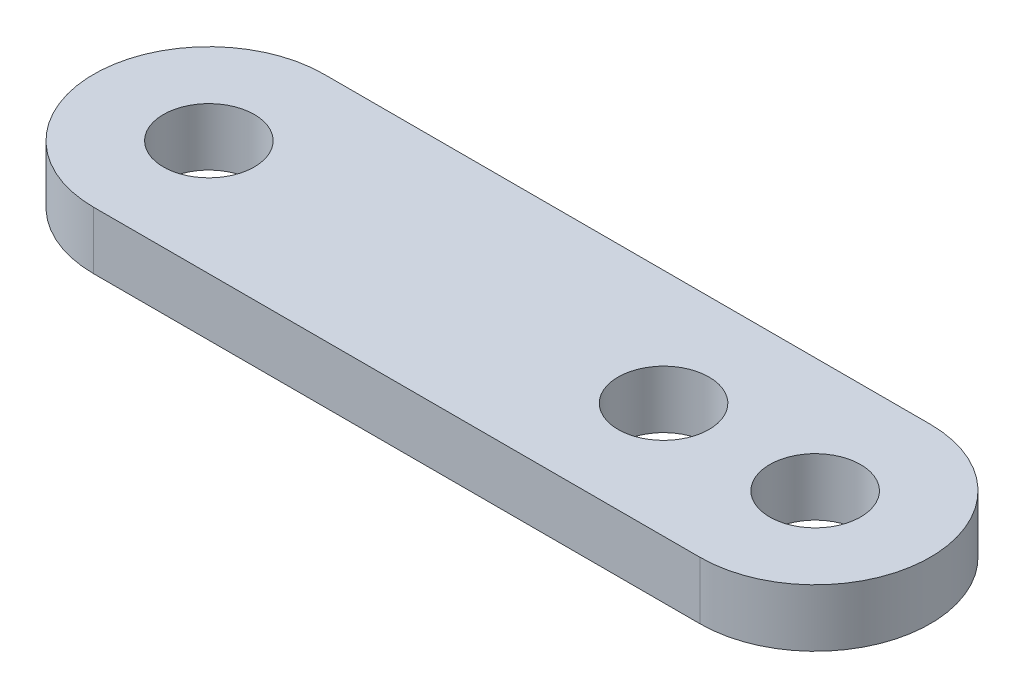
ISO-10303-21;
HEADER;
FILE_DESCRIPTION(('STEP AP214'),'2;1');
FILE_NAME('part.step','',(''),(''),'','','');
FILE_SCHEMA(('AUTOMOTIVE_DESIGN { 1 0 10303 214 1 1 1 1 }'));
ENDSEC;
DATA;
#1=APPLICATION_CONTEXT('core data for automotive mechanical design processes');
#2=APPLICATION_PROTOCOL_DEFINITION('international standard','automotive_design',2000,#1);
#3=PRODUCT_CONTEXT('',#1,'mechanical');
#4=PRODUCT('Part','Part','',(#3));
#5=PRODUCT_RELATED_PRODUCT_CATEGORY('part','',(#4));
#6=PRODUCT_DEFINITION_FORMATION('','',#4);
#7=PRODUCT_DEFINITION_CONTEXT('part definition',#1,'design');
#8=PRODUCT_DEFINITION('design','',#6,#7);
#9=PRODUCT_DEFINITION_SHAPE('','',#8);
#10=(LENGTH_UNIT() NAMED_UNIT(*) SI_UNIT(.MILLI.,.METRE.));
#11=(NAMED_UNIT(*) PLANE_ANGLE_UNIT() SI_UNIT($,.RADIAN.));
#12=(NAMED_UNIT(*) SI_UNIT($,.STERADIAN.) SOLID_ANGLE_UNIT());
#13=UNCERTAINTY_MEASURE_WITH_UNIT(LENGTH_MEASURE(1.E-05),#10,'distance_accuracy_value','');
#14=(GEOMETRIC_REPRESENTATION_CONTEXT(3) GLOBAL_UNCERTAINTY_ASSIGNED_CONTEXT((#13)) GLOBAL_UNIT_ASSIGNED_CONTEXT((#10,
#11,#12)) REPRESENTATION_CONTEXT('',''));
#15=CARTESIAN_POINT('',(0.,0.,0.));
#16=DIRECTION('',(0.,0.,1.));
#17=DIRECTION('',(1.,0.,0.));
#18=AXIS2_PLACEMENT_3D('',#15,#16,#17);
#19=CARTESIAN_POINT('',(-10.,1.9,0.));
#20=DIRECTION('',(0.,-1.,0.));
#21=DIRECTION('',(0.,0.,-1.));
#22=AXIS2_PLACEMENT_3D('',#19,#20,#21);
#23=CYLINDRICAL_SURFACE('',#22,3.8);
#24=CARTESIAN_POINT('',(-10.,0.,0.));
#25=DIRECTION('',(0.,1.,0.));
#26=DIRECTION('',(0.,0.,1.));
#27=AXIS2_PLACEMENT_3D('',#24,#25,#26);
#28=CIRCLE('',#27,3.8);
#29=CARTESIAN_POINT('',(-10.,0.,-3.8));
#30=VERTEX_POINT('',#29);
#31=CARTESIAN_POINT('',(-10.,0.,3.8));
#32=VERTEX_POINT('',#31);
#33=EDGE_CURVE('E129',#30,#32,#28,.T.);
#34=ORIENTED_EDGE('',*,*,#33,.T.);
#35=DIRECTION('',(0.,-1.,0.));
#36=VECTOR('',#35,1.);
#37=CARTESIAN_POINT('',(-10.,1.9,3.8));
#38=LINE('',#37,#36);
#39=CARTESIAN_POINT('',(-10.,1.9,3.8));
#40=VERTEX_POINT('',#39);
#41=EDGE_CURVE('E11',#40,#32,#38,.T.);
#42=ORIENTED_EDGE('',*,*,#41,.F.);
#43=CARTESIAN_POINT('',(-10.,1.9,0.));
#44=DIRECTION('',(0.,1.,0.));
#45=DIRECTION('',(0.,0.,1.));
#46=AXIS2_PLACEMENT_3D('',#43,#44,#45);
#47=CIRCLE('',#46,3.8);
#48=CARTESIAN_POINT('',(-10.,1.9,-3.8));
#49=VERTEX_POINT('',#48);
#50=EDGE_CURVE('E89',#49,#40,#47,.T.);
#51=ORIENTED_EDGE('',*,*,#50,.F.);
#52=DIRECTION('',(0.,-1.,0.));
#53=VECTOR('',#52,1.);
#54=CARTESIAN_POINT('',(-10.,1.9,-3.8));
#55=LINE('',#54,#53);
#56=EDGE_CURVE('E116',#49,#30,#55,.T.);
#57=ORIENTED_EDGE('',*,*,#56,.T.);
#58=EDGE_LOOP('',(#34,#42,#51,#57));
#59=FACE_BOUND('',#58,.T.);
#60=ADVANCED_FACE('F45',(#59),#23,.T.);
#61=CARTESIAN_POINT('',(0.,1.9,3.8));
#62=DIRECTION('',(0.,0.,1.));
#63=DIRECTION('',(1.,0.,0.));
#64=AXIS2_PLACEMENT_3D('',#61,#62,#63);
#65=PLANE('',#64);
#66=DIRECTION('',(-1.,0.,0.));
#67=VECTOR('',#66,1.);
#68=CARTESIAN_POINT('',(0.,0.,3.8));
#69=LINE('',#68,#67);
#70=CARTESIAN_POINT('',(9.99999999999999,0.,3.8));
#71=VERTEX_POINT('',#70);
#72=EDGE_CURVE('E99',#71,#32,#69,.T.);
#73=ORIENTED_EDGE('',*,*,#72,.F.);
#74=DIRECTION('',(0.,-1.,0.));
#75=VECTOR('',#74,1.);
#76=CARTESIAN_POINT('',(9.99999999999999,1.9,3.8));
#77=LINE('',#76,#75);
#78=CARTESIAN_POINT('',(9.99999999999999,1.9,3.8));
#79=VERTEX_POINT('',#78);
#80=EDGE_CURVE('E55',#79,#71,#77,.T.);
#81=ORIENTED_EDGE('',*,*,#80,.F.);
#82=DIRECTION('',(-1.,0.,0.));
#83=VECTOR('',#82,1.);
#84=CARTESIAN_POINT('',(0.,1.9,3.8));
#85=LINE('',#84,#83);
#86=EDGE_CURVE('E97',#79,#40,#85,.T.);
#87=ORIENTED_EDGE('',*,*,#86,.T.);
#88=ORIENTED_EDGE('',*,*,#41,.T.);
#89=EDGE_LOOP('',(#73,#81,#87,#88));
#90=FACE_BOUND('',#89,.T.);
#91=ADVANCED_FACE('F96',(#90),#65,.T.);
#92=CARTESIAN_POINT('',(10.,1.9,0.));
#93=DIRECTION('',(0.,-1.,0.));
#94=DIRECTION('',(0.,0.,-1.));
#95=AXIS2_PLACEMENT_3D('',#92,#93,#94);
#96=CYLINDRICAL_SURFACE('',#95,3.8);
#97=CARTESIAN_POINT('',(10.,0.,0.));
#98=DIRECTION('',(0.,1.,0.));
#99=DIRECTION('',(0.,0.,1.));
#100=AXIS2_PLACEMENT_3D('',#97,#98,#99);
#101=CIRCLE('',#100,3.8);
#102=CARTESIAN_POINT('',(9.99999999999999,0.,-3.8));
#103=VERTEX_POINT('',#102);
#104=EDGE_CURVE('E78',#71,#103,#101,.T.);
#105=ORIENTED_EDGE('',*,*,#104,.T.);
#106=DIRECTION('',(0.,-1.,0.));
#107=VECTOR('',#106,1.);
#108=CARTESIAN_POINT('',(9.99999999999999,1.9,-3.8));
#109=LINE('',#108,#107);
#110=CARTESIAN_POINT('',(9.99999999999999,1.9,-3.8));
#111=VERTEX_POINT('',#110);
#112=EDGE_CURVE('E101',#111,#103,#109,.T.);
#113=ORIENTED_EDGE('',*,*,#112,.F.);
#114=CARTESIAN_POINT('',(10.,1.9,0.));
#115=DIRECTION('',(0.,1.,0.));
#116=DIRECTION('',(0.,0.,1.));
#117=AXIS2_PLACEMENT_3D('',#114,#115,#116);
#118=CIRCLE('',#117,3.8);
#119=EDGE_CURVE('E102',#79,#111,#118,.T.);
#120=ORIENTED_EDGE('',*,*,#119,.F.);
#121=ORIENTED_EDGE('',*,*,#80,.T.);
#122=EDGE_LOOP('',(#105,#113,#120,#121));
#123=FACE_BOUND('',#122,.T.);
#124=ADVANCED_FACE('F103',(#123),#96,.T.);
#125=CARTESIAN_POINT('',(-10.,1.9,0.));
#126=DIRECTION('',(0.,-1.,0.));
#127=DIRECTION('',(0.,0.,-1.));
#128=AXIS2_PLACEMENT_3D('',#125,#126,#127);
#129=CYLINDRICAL_SURFACE('',#128,1.5);
#130=CARTESIAN_POINT('',(-10.,1.9,0.));
#131=DIRECTION('',(0.,1.,0.));
#132=DIRECTION('',(0.,0.,1.));
#133=AXIS2_PLACEMENT_3D('',#130,#131,#132);
#134=CIRCLE('',#133,1.5);
#135=CARTESIAN_POINT('',(-10.,1.9,-1.5));
#136=VERTEX_POINT('',#135);
#137=EDGE_CURVE('E110',#136,#136,#134,.T.);
#138=CARTESIAN_POINT('',(-10.,0.,0.));
#139=DIRECTION('',(0.,1.,0.));
#140=DIRECTION('',(0.,0.,1.));
#141=AXIS2_PLACEMENT_3D('',#138,#139,#140);
#142=CIRCLE('',#141,1.5);
#143=CARTESIAN_POINT('',(-10.,0.,-1.5));
#144=VERTEX_POINT('',#143);
#145=EDGE_CURVE('E125',#144,#144,#142,.T.);
#146=CARTESIAN_POINT('',(-10.,1.9,-1.5));
#147=CARTESIAN_POINT('',(-10.,1.88020833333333,-1.5));
#148=CARTESIAN_POINT('',(-10.,1.86041666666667,-1.5));
#149=CARTESIAN_POINT('',(-10.,1.82083333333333,-1.5));
#150=CARTESIAN_POINT('',(-10.,1.80104166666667,-1.5));
#151=CARTESIAN_POINT('',(-10.,1.76145833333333,-1.5));
#152=CARTESIAN_POINT('',(-10.,1.74166666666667,-1.5));
#153=CARTESIAN_POINT('',(-10.,1.70208333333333,-1.5));
#154=CARTESIAN_POINT('',(-10.,1.68229166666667,-1.5));
#155=CARTESIAN_POINT('',(-10.,1.64270833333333,-1.5));
#156=CARTESIAN_POINT('',(-10.,1.62291666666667,-1.5));
#157=CARTESIAN_POINT('',(-10.,1.58333333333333,-1.5));
#158=CARTESIAN_POINT('',(-10.,1.56354166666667,-1.5));
#159=CARTESIAN_POINT('',(-10.,1.52395833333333,-1.5));
#160=CARTESIAN_POINT('',(-10.,1.50416666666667,-1.5));
#161=CARTESIAN_POINT('',(-10.,1.46458333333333,-1.5));
#162=CARTESIAN_POINT('',(-10.,1.44479166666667,-1.5));
#163=CARTESIAN_POINT('',(-10.,1.40520833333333,-1.5));
#164=CARTESIAN_POINT('',(-10.,1.38541666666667,-1.5));
#165=CARTESIAN_POINT('',(-10.,1.34583333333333,-1.5));
#166=CARTESIAN_POINT('',(-10.,1.32604166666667,-1.5));
#167=CARTESIAN_POINT('',(-10.,1.28645833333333,-1.5));
#168=CARTESIAN_POINT('',(-10.,1.26666666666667,-1.5));
#169=CARTESIAN_POINT('',(-10.,1.22708333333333,-1.5));
#170=CARTESIAN_POINT('',(-10.,1.20729166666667,-1.5));
#171=CARTESIAN_POINT('',(-10.,1.16770833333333,-1.5));
#172=CARTESIAN_POINT('',(-10.,1.14791666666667,-1.5));
#173=CARTESIAN_POINT('',(-10.,1.10833333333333,-1.5));
#174=CARTESIAN_POINT('',(-10.,1.08854166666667,-1.5));
#175=CARTESIAN_POINT('',(-10.,1.04895833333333,-1.5));
#176=CARTESIAN_POINT('',(-10.,1.02916666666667,-1.5));
#177=CARTESIAN_POINT('',(-10.,0.989583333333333,-1.5));
#178=CARTESIAN_POINT('',(-10.,0.969791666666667,-1.5));
#179=CARTESIAN_POINT('',(-10.,0.930208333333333,-1.5));
#180=CARTESIAN_POINT('',(-10.,0.910416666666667,-1.5));
#181=CARTESIAN_POINT('',(-10.,0.870833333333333,-1.5));
#182=CARTESIAN_POINT('',(-10.,0.851041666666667,-1.5));
#183=CARTESIAN_POINT('',(-10.,0.811458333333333,-1.5));
#184=CARTESIAN_POINT('',(-10.,0.791666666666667,-1.5));
#185=CARTESIAN_POINT('',(-10.,0.752083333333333,-1.5));
#186=CARTESIAN_POINT('',(-10.,0.732291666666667,-1.5));
#187=CARTESIAN_POINT('',(-10.,0.692708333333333,-1.5));
#188=CARTESIAN_POINT('',(-10.,0.672916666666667,-1.5));
#189=CARTESIAN_POINT('',(-10.,0.633333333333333,-1.5));
#190=CARTESIAN_POINT('',(-10.,0.613541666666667,-1.5));
#191=CARTESIAN_POINT('',(-10.,0.573958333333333,-1.5));
#192=CARTESIAN_POINT('',(-10.,0.554166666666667,-1.5));
#193=CARTESIAN_POINT('',(-10.,0.514583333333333,-1.5));
#194=CARTESIAN_POINT('',(-10.,0.494791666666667,-1.5));
#195=CARTESIAN_POINT('',(-10.,0.455208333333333,-1.5));
#196=CARTESIAN_POINT('',(-10.,0.435416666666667,-1.5));
#197=CARTESIAN_POINT('',(-10.,0.395833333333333,-1.5));
#198=CARTESIAN_POINT('',(-10.,0.376041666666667,-1.5));
#199=CARTESIAN_POINT('',(-10.,0.336458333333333,-1.5));
#200=CARTESIAN_POINT('',(-10.,0.316666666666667,-1.5));
#201=CARTESIAN_POINT('',(-10.,0.277083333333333,-1.5));
#202=CARTESIAN_POINT('',(-10.,0.257291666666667,-1.5));
#203=CARTESIAN_POINT('',(-10.,0.217708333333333,-1.5));
#204=CARTESIAN_POINT('',(-10.,0.197916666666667,-1.5));
#205=CARTESIAN_POINT('',(-10.,0.158333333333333,-1.5));
#206=CARTESIAN_POINT('',(-10.,0.138541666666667,-1.5));
#207=CARTESIAN_POINT('',(-10.,0.0989583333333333,-1.5));
#208=CARTESIAN_POINT('',(-10.,0.0791666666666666,-1.5));
#209=CARTESIAN_POINT('',(-10.,0.0395833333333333,-1.5));
#210=CARTESIAN_POINT('',(-10.,0.0197916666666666,-1.5));
#211=CARTESIAN_POINT('',(-10.,0.,-1.5));
#212=B_SPLINE_CURVE_WITH_KNOTS('',3,(#146,#147,#148,#149,#150,#151,#152,#153,#154,#155,#156,
#157,#158,#159,#160,#161,#162,#163,#164,#165,#166,#167,#168,#169,#170,#171,#172,#173,#174,#175,
#176,#177,#178,#179,#180,#181,#182,#183,#184,#185,#186,#187,#188,#189,#190,#191,#192,#193,#194,
#195,#196,#197,#198,#199,#200,#201,#202,#203,#204,#205,#206,#207,#208,#209,#210,#211),
.UNSPECIFIED.,.F.,.F.,(4,2,2,2,2,2,2,2,2,2,2,2,2,2,2,2,2,2,2,2,2,2,2,2,2,2,2,2,2,2,2,2,4),(0.,
0.059375,0.11875,0.178125,0.2375,0.296875,0.35625,0.415625,0.475,0.534375,0.59375,0.653125,
0.7125,0.771875,0.83125,0.890625,0.95,1.009375,1.06875,1.128125,1.1875,1.246875,1.30625,
1.365625,1.425,1.484375,1.54375,1.603125,1.6625,1.721875,1.78125,1.840625,1.9),.UNSPECIFIED.);
#213=EDGE_CURVE('BSEAM156',#136,#144,#212,.T.);
#214=ORIENTED_EDGE('',*,*,#137,.T.);
#215=ORIENTED_EDGE('',*,*,#145,.F.);
#216=ORIENTED_EDGE('',*,*,#213,.T.);
#217=ORIENTED_EDGE('',*,*,#213,.F.);
#218=EDGE_LOOP('',(#214,#216,#215,#217));
#219=FACE_BOUND('',#218,.T.);
#220=ADVANCED_FACE('F156',(#219),#129,.F.);
#221=CARTESIAN_POINT('',(5.,1.9,0.));
#222=DIRECTION('',(0.,-1.,0.));
#223=DIRECTION('',(0.,0.,-1.));
#224=AXIS2_PLACEMENT_3D('',#221,#222,#223);
#225=CYLINDRICAL_SURFACE('',#224,1.5);
#226=CARTESIAN_POINT('',(5.,1.9,0.));
#227=DIRECTION('',(0.,1.,0.));
#228=DIRECTION('',(0.,0.,1.));
#229=AXIS2_PLACEMENT_3D('',#226,#227,#228);
#230=CIRCLE('',#229,1.5);
#231=CARTESIAN_POINT('',(5.,1.9,-1.49999999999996));
#232=VERTEX_POINT('',#231);
#233=EDGE_CURVE('E169',#232,#232,#230,.T.);
#234=CARTESIAN_POINT('',(5.,0.,0.));
#235=DIRECTION('',(0.,1.,0.));
#236=DIRECTION('',(0.,0.,1.));
#237=AXIS2_PLACEMENT_3D('',#234,#235,#236);
#238=CIRCLE('',#237,1.5);
#239=CARTESIAN_POINT('',(5.,0.,-1.49999999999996));
#240=VERTEX_POINT('',#239);
#241=EDGE_CURVE('E121',#240,#240,#238,.T.);
#242=CARTESIAN_POINT('',(5.,1.9,-1.49999999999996));
#243=CARTESIAN_POINT('',(5.,1.88020833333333,-1.49999999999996));
#244=CARTESIAN_POINT('',(5.,1.86041666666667,-1.49999999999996));
#245=CARTESIAN_POINT('',(5.,1.82083333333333,-1.49999999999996));
#246=CARTESIAN_POINT('',(5.,1.80104166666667,-1.49999999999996));
#247=CARTESIAN_POINT('',(5.,1.76145833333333,-1.49999999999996));
#248=CARTESIAN_POINT('',(5.,1.74166666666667,-1.49999999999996));
#249=CARTESIAN_POINT('',(5.,1.70208333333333,-1.49999999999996));
#250=CARTESIAN_POINT('',(5.,1.68229166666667,-1.49999999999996));
#251=CARTESIAN_POINT('',(5.,1.64270833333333,-1.49999999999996));
#252=CARTESIAN_POINT('',(5.,1.62291666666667,-1.49999999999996));
#253=CARTESIAN_POINT('',(5.,1.58333333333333,-1.49999999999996));
#254=CARTESIAN_POINT('',(5.,1.56354166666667,-1.49999999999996));
#255=CARTESIAN_POINT('',(5.,1.52395833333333,-1.49999999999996));
#256=CARTESIAN_POINT('',(5.,1.50416666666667,-1.49999999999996));
#257=CARTESIAN_POINT('',(5.,1.46458333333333,-1.49999999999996));
#258=CARTESIAN_POINT('',(5.,1.44479166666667,-1.49999999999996));
#259=CARTESIAN_POINT('',(5.,1.40520833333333,-1.49999999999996));
#260=CARTESIAN_POINT('',(5.,1.38541666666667,-1.49999999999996));
#261=CARTESIAN_POINT('',(5.,1.34583333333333,-1.49999999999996));
#262=CARTESIAN_POINT('',(5.,1.32604166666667,-1.49999999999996));
#263=CARTESIAN_POINT('',(5.,1.28645833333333,-1.49999999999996));
#264=CARTESIAN_POINT('',(5.,1.26666666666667,-1.49999999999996));
#265=CARTESIAN_POINT('',(5.,1.22708333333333,-1.49999999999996));
#266=CARTESIAN_POINT('',(5.,1.20729166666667,-1.49999999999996));
#267=CARTESIAN_POINT('',(5.,1.16770833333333,-1.49999999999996));
#268=CARTESIAN_POINT('',(5.,1.14791666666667,-1.49999999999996));
#269=CARTESIAN_POINT('',(5.,1.10833333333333,-1.49999999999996));
#270=CARTESIAN_POINT('',(5.,1.08854166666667,-1.49999999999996));
#271=CARTESIAN_POINT('',(5.,1.04895833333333,-1.49999999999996));
#272=CARTESIAN_POINT('',(5.,1.02916666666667,-1.49999999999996));
#273=CARTESIAN_POINT('',(5.,0.989583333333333,-1.49999999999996));
#274=CARTESIAN_POINT('',(5.,0.969791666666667,-1.49999999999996));
#275=CARTESIAN_POINT('',(5.,0.930208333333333,-1.49999999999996));
#276=CARTESIAN_POINT('',(5.,0.910416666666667,-1.49999999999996));
#277=CARTESIAN_POINT('',(5.,0.870833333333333,-1.49999999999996));
#278=CARTESIAN_POINT('',(5.,0.851041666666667,-1.49999999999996));
#279=CARTESIAN_POINT('',(5.,0.811458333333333,-1.49999999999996));
#280=CARTESIAN_POINT('',(5.,0.791666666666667,-1.49999999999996));
#281=CARTESIAN_POINT('',(5.,0.752083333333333,-1.49999999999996));
#282=CARTESIAN_POINT('',(5.,0.732291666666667,-1.49999999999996));
#283=CARTESIAN_POINT('',(5.,0.692708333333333,-1.49999999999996));
#284=CARTESIAN_POINT('',(5.,0.672916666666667,-1.49999999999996));
#285=CARTESIAN_POINT('',(5.,0.633333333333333,-1.49999999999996));
#286=CARTESIAN_POINT('',(5.,0.613541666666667,-1.49999999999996));
#287=CARTESIAN_POINT('',(5.,0.573958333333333,-1.49999999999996));
#288=CARTESIAN_POINT('',(5.,0.554166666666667,-1.49999999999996));
#289=CARTESIAN_POINT('',(5.,0.514583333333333,-1.49999999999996));
#290=CARTESIAN_POINT('',(5.,0.494791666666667,-1.49999999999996));
#291=CARTESIAN_POINT('',(5.,0.455208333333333,-1.49999999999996));
#292=CARTESIAN_POINT('',(5.,0.435416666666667,-1.49999999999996));
#293=CARTESIAN_POINT('',(5.,0.395833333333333,-1.49999999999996));
#294=CARTESIAN_POINT('',(5.,0.376041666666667,-1.49999999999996));
#295=CARTESIAN_POINT('',(5.,0.336458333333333,-1.49999999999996));
#296=CARTESIAN_POINT('',(5.,0.316666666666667,-1.49999999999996));
#297=CARTESIAN_POINT('',(5.,0.277083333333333,-1.49999999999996));
#298=CARTESIAN_POINT('',(5.,0.257291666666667,-1.49999999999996));
#299=CARTESIAN_POINT('',(5.,0.217708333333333,-1.49999999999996));
#300=CARTESIAN_POINT('',(5.,0.197916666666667,-1.49999999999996));
#301=CARTESIAN_POINT('',(5.,0.158333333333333,-1.49999999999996));
#302=CARTESIAN_POINT('',(5.,0.138541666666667,-1.49999999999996));
#303=CARTESIAN_POINT('',(5.,0.0989583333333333,-1.49999999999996));
#304=CARTESIAN_POINT('',(5.,0.0791666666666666,-1.49999999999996));
#305=CARTESIAN_POINT('',(5.,0.0395833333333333,-1.49999999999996));
#306=CARTESIAN_POINT('',(5.,0.0197916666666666,-1.49999999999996));
#307=CARTESIAN_POINT('',(5.,0.,-1.49999999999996));
#308=B_SPLINE_CURVE_WITH_KNOTS('',3,(#242,#243,#244,#245,#246,#247,#248,#249,#250,#251,#252,
#253,#254,#255,#256,#257,#258,#259,#260,#261,#262,#263,#264,#265,#266,#267,#268,#269,#270,#271,
#272,#273,#274,#275,#276,#277,#278,#279,#280,#281,#282,#283,#284,#285,#286,#287,#288,#289,#290,
#291,#292,#293,#294,#295,#296,#297,#298,#299,#300,#301,#302,#303,#304,#305,#306,#307),
.UNSPECIFIED.,.F.,.F.,(4,2,2,2,2,2,2,2,2,2,2,2,2,2,2,2,2,2,2,2,2,2,2,2,2,2,2,2,2,2,2,2,4),(0.,
0.059375,0.11875,0.178125,0.2375,0.296875,0.35625,0.415625,0.475,0.534375,0.59375,0.653125,
0.7125,0.771875,0.83125,0.890625,0.95,1.009375,1.06875,1.128125,1.1875,1.246875,1.30625,
1.365625,1.425,1.484375,1.54375,1.603125,1.6625,1.721875,1.78125,1.840625,1.9),.UNSPECIFIED.);
#309=EDGE_CURVE('BSEAM158',#232,#240,#308,.T.);
#310=ORIENTED_EDGE('',*,*,#233,.T.);
#311=ORIENTED_EDGE('',*,*,#241,.F.);
#312=ORIENTED_EDGE('',*,*,#309,.T.);
#313=ORIENTED_EDGE('',*,*,#309,.F.);
#314=EDGE_LOOP('',(#310,#312,#311,#313));
#315=FACE_BOUND('',#314,.T.);
#316=ADVANCED_FACE('F158',(#315),#225,.F.);
#317=CARTESIAN_POINT('',(10.,1.9,0.));
#318=DIRECTION('',(0.,-1.,0.));
#319=DIRECTION('',(0.,0.,-1.));
#320=AXIS2_PLACEMENT_3D('',#317,#318,#319);
#321=CYLINDRICAL_SURFACE('',#320,1.5);
#322=CARTESIAN_POINT('',(10.,1.9,0.));
#323=DIRECTION('',(0.,1.,0.));
#324=DIRECTION('',(0.,0.,1.));
#325=AXIS2_PLACEMENT_3D('',#322,#323,#324);
#326=CIRCLE('',#325,1.5);
#327=CARTESIAN_POINT('',(10.,1.9,-1.5));
#328=VERTEX_POINT('',#327);
#329=EDGE_CURVE('E139',#328,#328,#326,.T.);
#330=CARTESIAN_POINT('',(10.,0.,0.));
#331=DIRECTION('',(0.,1.,0.));
#332=DIRECTION('',(0.,0.,1.));
#333=AXIS2_PLACEMENT_3D('',#330,#331,#332);
#334=CIRCLE('',#333,1.5);
#335=CARTESIAN_POINT('',(10.,0.,-1.5));
#336=VERTEX_POINT('',#335);
#337=EDGE_CURVE('E117',#336,#336,#334,.T.);
#338=CARTESIAN_POINT('',(10.,1.9,-1.5));
#339=CARTESIAN_POINT('',(10.,1.88020833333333,-1.5));
#340=CARTESIAN_POINT('',(10.,1.86041666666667,-1.5));
#341=CARTESIAN_POINT('',(10.,1.82083333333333,-1.5));
#342=CARTESIAN_POINT('',(10.,1.80104166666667,-1.5));
#343=CARTESIAN_POINT('',(10.,1.76145833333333,-1.5));
#344=CARTESIAN_POINT('',(10.,1.74166666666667,-1.5));
#345=CARTESIAN_POINT('',(10.,1.70208333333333,-1.5));
#346=CARTESIAN_POINT('',(10.,1.68229166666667,-1.5));
#347=CARTESIAN_POINT('',(10.,1.64270833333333,-1.5));
#348=CARTESIAN_POINT('',(10.,1.62291666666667,-1.5));
#349=CARTESIAN_POINT('',(10.,1.58333333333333,-1.5));
#350=CARTESIAN_POINT('',(10.,1.56354166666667,-1.5));
#351=CARTESIAN_POINT('',(10.,1.52395833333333,-1.5));
#352=CARTESIAN_POINT('',(10.,1.50416666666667,-1.5));
#353=CARTESIAN_POINT('',(10.,1.46458333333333,-1.5));
#354=CARTESIAN_POINT('',(10.,1.44479166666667,-1.5));
#355=CARTESIAN_POINT('',(10.,1.40520833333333,-1.5));
#356=CARTESIAN_POINT('',(10.,1.38541666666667,-1.5));
#357=CARTESIAN_POINT('',(10.,1.34583333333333,-1.5));
#358=CARTESIAN_POINT('',(10.,1.32604166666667,-1.5));
#359=CARTESIAN_POINT('',(10.,1.28645833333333,-1.5));
#360=CARTESIAN_POINT('',(10.,1.26666666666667,-1.5));
#361=CARTESIAN_POINT('',(10.,1.22708333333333,-1.5));
#362=CARTESIAN_POINT('',(10.,1.20729166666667,-1.5));
#363=CARTESIAN_POINT('',(10.,1.16770833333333,-1.5));
#364=CARTESIAN_POINT('',(10.,1.14791666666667,-1.5));
#365=CARTESIAN_POINT('',(10.,1.10833333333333,-1.5));
#366=CARTESIAN_POINT('',(10.,1.08854166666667,-1.5));
#367=CARTESIAN_POINT('',(10.,1.04895833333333,-1.5));
#368=CARTESIAN_POINT('',(10.,1.02916666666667,-1.5));
#369=CARTESIAN_POINT('',(10.,0.989583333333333,-1.5));
#370=CARTESIAN_POINT('',(10.,0.969791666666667,-1.5));
#371=CARTESIAN_POINT('',(10.,0.930208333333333,-1.5));
#372=CARTESIAN_POINT('',(10.,0.910416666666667,-1.5));
#373=CARTESIAN_POINT('',(10.,0.870833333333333,-1.5));
#374=CARTESIAN_POINT('',(10.,0.851041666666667,-1.5));
#375=CARTESIAN_POINT('',(10.,0.811458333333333,-1.5));
#376=CARTESIAN_POINT('',(10.,0.791666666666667,-1.5));
#377=CARTESIAN_POINT('',(10.,0.752083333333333,-1.5));
#378=CARTESIAN_POINT('',(10.,0.732291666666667,-1.5));
#379=CARTESIAN_POINT('',(10.,0.692708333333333,-1.5));
#380=CARTESIAN_POINT('',(10.,0.672916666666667,-1.5));
#381=CARTESIAN_POINT('',(10.,0.633333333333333,-1.5));
#382=CARTESIAN_POINT('',(10.,0.613541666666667,-1.5));
#383=CARTESIAN_POINT('',(10.,0.573958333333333,-1.5));
#384=CARTESIAN_POINT('',(10.,0.554166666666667,-1.5));
#385=CARTESIAN_POINT('',(10.,0.514583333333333,-1.5));
#386=CARTESIAN_POINT('',(10.,0.494791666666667,-1.5));
#387=CARTESIAN_POINT('',(10.,0.455208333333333,-1.5));
#388=CARTESIAN_POINT('',(10.,0.435416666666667,-1.5));
#389=CARTESIAN_POINT('',(10.,0.395833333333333,-1.5));
#390=CARTESIAN_POINT('',(10.,0.376041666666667,-1.5));
#391=CARTESIAN_POINT('',(10.,0.336458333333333,-1.5));
#392=CARTESIAN_POINT('',(10.,0.316666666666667,-1.5));
#393=CARTESIAN_POINT('',(10.,0.277083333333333,-1.5));
#394=CARTESIAN_POINT('',(10.,0.257291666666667,-1.5));
#395=CARTESIAN_POINT('',(10.,0.217708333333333,-1.5));
#396=CARTESIAN_POINT('',(10.,0.197916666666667,-1.5));
#397=CARTESIAN_POINT('',(10.,0.158333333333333,-1.5));
#398=CARTESIAN_POINT('',(10.,0.138541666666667,-1.5));
#399=CARTESIAN_POINT('',(10.,0.0989583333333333,-1.5));
#400=CARTESIAN_POINT('',(10.,0.0791666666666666,-1.5));
#401=CARTESIAN_POINT('',(10.,0.0395833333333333,-1.5));
#402=CARTESIAN_POINT('',(10.,0.0197916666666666,-1.5));
#403=CARTESIAN_POINT('',(10.,0.,-1.5));
#404=B_SPLINE_CURVE_WITH_KNOTS('',3,(#338,#339,#340,#341,#342,#343,#344,#345,#346,#347,#348,
#349,#350,#351,#352,#353,#354,#355,#356,#357,#358,#359,#360,#361,#362,#363,#364,#365,#366,#367,
#368,#369,#370,#371,#372,#373,#374,#375,#376,#377,#378,#379,#380,#381,#382,#383,#384,#385,#386,
#387,#388,#389,#390,#391,#392,#393,#394,#395,#396,#397,#398,#399,#400,#401,#402,#403),
.UNSPECIFIED.,.F.,.F.,(4,2,2,2,2,2,2,2,2,2,2,2,2,2,2,2,2,2,2,2,2,2,2,2,2,2,2,2,2,2,2,2,4),(0.,
0.059375,0.11875,0.178125,0.2375,0.296875,0.35625,0.415625,0.475,0.534375,0.59375,0.653125,
0.7125,0.771875,0.83125,0.890625,0.95,1.009375,1.06875,1.128125,1.1875,1.246875,1.30625,
1.365625,1.425,1.484375,1.54375,1.603125,1.6625,1.721875,1.78125,1.840625,1.9),.UNSPECIFIED.);
#405=EDGE_CURVE('BSEAM47',#328,#336,#404,.T.);
#406=ORIENTED_EDGE('',*,*,#329,.T.);
#407=ORIENTED_EDGE('',*,*,#337,.F.);
#408=ORIENTED_EDGE('',*,*,#405,.T.);
#409=ORIENTED_EDGE('',*,*,#405,.F.);
#410=EDGE_LOOP('',(#406,#408,#407,#409));
#411=FACE_BOUND('',#410,.T.);
#412=ADVANCED_FACE('F47',(#411),#321,.F.);
#413=CARTESIAN_POINT('',(0.,1.9,-3.8));
#414=DIRECTION('',(0.,0.,1.));
#415=DIRECTION('',(1.,0.,0.));
#416=AXIS2_PLACEMENT_3D('',#413,#414,#415);
#417=PLANE('',#416);
#418=DIRECTION('',(-1.,0.,0.));
#419=VECTOR('',#418,1.);
#420=CARTESIAN_POINT('',(0.,0.,-3.8));
#421=LINE('',#420,#419);
#422=EDGE_CURVE('E84',#103,#30,#421,.T.);
#423=ORIENTED_EDGE('',*,*,#422,.T.);
#424=ORIENTED_EDGE('',*,*,#56,.F.);
#425=DIRECTION('',(-1.,0.,0.));
#426=VECTOR('',#425,1.);
#427=CARTESIAN_POINT('',(0.,1.9,-3.8));
#428=LINE('',#427,#426);
#429=EDGE_CURVE('E63',#111,#49,#428,.T.);
#430=ORIENTED_EDGE('',*,*,#429,.F.);
#431=ORIENTED_EDGE('',*,*,#112,.T.);
#432=EDGE_LOOP('',(#423,#424,#430,#431));
#433=FACE_BOUND('',#432,.T.);
#434=ADVANCED_FACE('F143',(#433),#417,.F.);
#435=CARTESIAN_POINT('',(0.,1.9,0.));
#436=DIRECTION('',(0.,1.,0.));
#437=DIRECTION('',(0.,0.,1.));
#438=AXIS2_PLACEMENT_3D('',#435,#436,#437);
#439=PLANE('',#438);
#440=ORIENTED_EDGE('',*,*,#329,.F.);
#441=EDGE_LOOP('',(#440));
#442=FACE_BOUND('',#441,.T.);
#443=ORIENTED_EDGE('',*,*,#233,.F.);
#444=EDGE_LOOP('',(#443));
#445=FACE_BOUND('',#444,.T.);
#446=ORIENTED_EDGE('',*,*,#137,.F.);
#447=EDGE_LOOP('',(#446));
#448=FACE_BOUND('',#447,.T.);
#449=ORIENTED_EDGE('',*,*,#50,.T.);
#450=ORIENTED_EDGE('',*,*,#86,.F.);
#451=ORIENTED_EDGE('',*,*,#119,.T.);
#452=ORIENTED_EDGE('',*,*,#429,.T.);
#453=EDGE_LOOP('',(#449,#450,#451,#452));
#454=FACE_BOUND('',#453,.T.);
#455=ADVANCED_FACE('F106',(#442,#445,#448,#454),#439,.T.);
#456=CARTESIAN_POINT('',(0.,0.,0.));
#457=DIRECTION('',(0.,1.,0.));
#458=DIRECTION('',(0.,0.,1.));
#459=AXIS2_PLACEMENT_3D('',#456,#457,#458);
#460=PLANE('',#459);
#461=ORIENTED_EDGE('',*,*,#337,.T.);
#462=EDGE_LOOP('',(#461));
#463=FACE_BOUND('',#462,.T.);
#464=ORIENTED_EDGE('',*,*,#241,.T.);
#465=EDGE_LOOP('',(#464));
#466=FACE_BOUND('',#465,.T.);
#467=ORIENTED_EDGE('',*,*,#145,.T.);
#468=EDGE_LOOP('',(#467));
#469=FACE_BOUND('',#468,.T.);
#470=ORIENTED_EDGE('',*,*,#33,.F.);
#471=ORIENTED_EDGE('',*,*,#422,.F.);
#472=ORIENTED_EDGE('',*,*,#104,.F.);
#473=ORIENTED_EDGE('',*,*,#72,.T.);
#474=EDGE_LOOP('',(#470,#471,#472,#473));
#475=FACE_BOUND('',#474,.T.);
#476=ADVANCED_FACE('F146',(#463,#466,#469,#475),#460,.F.);
#477=CLOSED_SHELL('',(#60,#91,#124,#220,#316,#412,#434,#455,#476));
#478=MANIFOLD_SOLID_BREP('B2',#477);
#479=ADVANCED_BREP_SHAPE_REPRESENTATION('',(#18,#478),#14);
#480=SHAPE_DEFINITION_REPRESENTATION(#9,#479);
ENDSEC;
END-ISO-10303-21;
